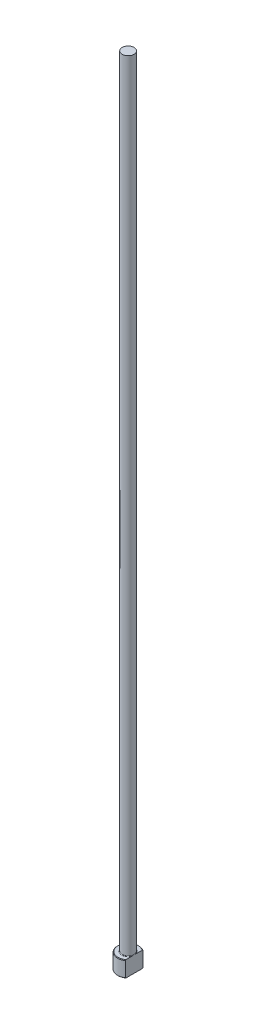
ISO-10303-21;
HEADER;
FILE_DESCRIPTION(('STEP AP214'),'2;1');
FILE_NAME('part.step','',(''),(''),'','','');
FILE_SCHEMA(('AUTOMOTIVE_DESIGN { 1 0 10303 214 1 1 1 1 }'));
ENDSEC;
DATA;
#1=APPLICATION_CONTEXT('core data for automotive mechanical design processes');
#2=APPLICATION_PROTOCOL_DEFINITION('international standard','automotive_design',2000,#1);
#3=PRODUCT_CONTEXT('',#1,'mechanical');
#4=PRODUCT('Part','Part','',(#3));
#5=PRODUCT_RELATED_PRODUCT_CATEGORY('part','',(#4));
#6=PRODUCT_DEFINITION_FORMATION('','',#4);
#7=PRODUCT_DEFINITION_CONTEXT('part definition',#1,'design');
#8=PRODUCT_DEFINITION('design','',#6,#7);
#9=PRODUCT_DEFINITION_SHAPE('','',#8);
#10=(LENGTH_UNIT() NAMED_UNIT(*) SI_UNIT(.MILLI.,.METRE.));
#11=(NAMED_UNIT(*) PLANE_ANGLE_UNIT() SI_UNIT($,.RADIAN.));
#12=(NAMED_UNIT(*) SI_UNIT($,.STERADIAN.) SOLID_ANGLE_UNIT());
#13=UNCERTAINTY_MEASURE_WITH_UNIT(LENGTH_MEASURE(1.E-05),#10,'distance_accuracy_value','');
#14=(GEOMETRIC_REPRESENTATION_CONTEXT(3) GLOBAL_UNCERTAINTY_ASSIGNED_CONTEXT((#13)) GLOBAL_UNIT_ASSIGNED_CONTEXT((#10,
#11,#12)) REPRESENTATION_CONTEXT('',''));
#15=CARTESIAN_POINT('',(0.,0.,0.));
#16=DIRECTION('',(0.,0.,1.));
#17=DIRECTION('',(1.,0.,0.));
#18=AXIS2_PLACEMENT_3D('',#15,#16,#17);
#19=CARTESIAN_POINT('',(0.,0.,0.));
#20=DIRECTION('',(0.,-1.,0.));
#21=DIRECTION('',(0.,0.,-1.));
#22=AXIS2_PLACEMENT_3D('',#19,#20,#21);
#23=PLANE('',#22);
#24=CARTESIAN_POINT('',(0.,0.,0.));
#25=DIRECTION('',(0.,-1.,0.));
#26=DIRECTION('',(0.,0.,-1.));
#27=AXIS2_PLACEMENT_3D('',#24,#25,#26);
#28=CIRCLE('',#27,3.79999999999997);
#29=CARTESIAN_POINT('',(2.24999999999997,0.,3.0622703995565));
#30=VERTEX_POINT('',#29);
#31=CARTESIAN_POINT('',(2.24999999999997,0.,-3.0622703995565));
#32=VERTEX_POINT('',#31);
#33=EDGE_CURVE('E98',#30,#32,#28,.T.);
#34=ORIENTED_EDGE('',*,*,#33,.T.);
#35=DIRECTION('',(0.,0.,1.));
#36=VECTOR('',#35,1.);
#37=CARTESIAN_POINT('',(2.24999999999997,0.,3.30718913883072));
#38=LINE('',#37,#36);
#39=EDGE_CURVE('E83',#32,#30,#38,.T.);
#40=ORIENTED_EDGE('',*,*,#39,.T.);
#41=EDGE_LOOP('',(#34,#40));
#42=FACE_BOUND('',#41,.T.);
#43=ADVANCED_FACE('F32',(#42),#23,.T.);
#44=CARTESIAN_POINT('',(0.,259.958771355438,0.));
#45=DIRECTION('',(0.,1.,0.));
#46=DIRECTION('',(0.,0.,1.));
#47=AXIS2_PLACEMENT_3D('',#44,#45,#46);
#48=CYLINDRICAL_SURFACE('',#47,3.99999999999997);
#49=CARTESIAN_POINT('',(0.,5.80000000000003,0.));
#50=DIRECTION('',(0.,1.,0.));
#51=DIRECTION('',(0.,0.,1.));
#52=AXIS2_PLACEMENT_3D('',#49,#50,#51);
#53=CIRCLE('',#52,3.99999999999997);
#54=CARTESIAN_POINT('',(2.24999999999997,5.80000000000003,3.30718913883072));
#55=VERTEX_POINT('',#54);
#56=CARTESIAN_POINT('',(2.24999999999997,5.80000000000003,-3.30718913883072));
#57=VERTEX_POINT('',#56);
#58=EDGE_CURVE('E104',#55,#57,#53,.F.);
#59=ORIENTED_EDGE('',*,*,#58,.T.);
#60=DIRECTION('',(0.,-1.,0.));
#61=VECTOR('',#60,1.);
#62=CARTESIAN_POINT('',(2.24999999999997,300.,-3.30718913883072));
#63=LINE('',#62,#61);
#64=CARTESIAN_POINT('',(2.24999999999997,0.199999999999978,-3.30718913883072));
#65=VERTEX_POINT('',#64);
#66=EDGE_CURVE('E183',#57,#65,#63,.T.);
#67=ORIENTED_EDGE('',*,*,#66,.T.);
#68=CARTESIAN_POINT('',(0.,0.199999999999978,0.));
#69=DIRECTION('',(0.,-1.,0.));
#70=DIRECTION('',(0.,0.,-1.));
#71=AXIS2_PLACEMENT_3D('',#68,#69,#70);
#72=CIRCLE('',#71,3.99999999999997);
#73=CARTESIAN_POINT('',(2.24999999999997,0.199999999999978,3.30718913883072));
#74=VERTEX_POINT('',#73);
#75=EDGE_CURVE('E100',#65,#74,#72,.F.);
#76=ORIENTED_EDGE('',*,*,#75,.T.);
#77=DIRECTION('',(0.,-1.,0.));
#78=VECTOR('',#77,1.);
#79=CARTESIAN_POINT('',(2.24999999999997,300.,3.30718913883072));
#80=LINE('',#79,#78);
#81=EDGE_CURVE('E93',#55,#74,#80,.T.);
#82=ORIENTED_EDGE('',*,*,#81,.F.);
#83=EDGE_LOOP('',(#59,#67,#76,#82));
#84=FACE_BOUND('',#83,.T.);
#85=ADVANCED_FACE('F158',(#84),#48,.T.);
#86=CARTESIAN_POINT('',(-3.99999999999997,6.,0.));
#87=DIRECTION('',(0.,1.,0.));
#88=DIRECTION('',(0.,0.,1.));
#89=AXIS2_PLACEMENT_3D('',#86,#87,#88);
#90=PLANE('',#89);
#91=CARTESIAN_POINT('',(0.,6.,0.));
#92=DIRECTION('',(0.,1.,0.));
#93=DIRECTION('',(0.,0.,1.));
#94=AXIS2_PLACEMENT_3D('',#91,#92,#93);
#95=CIRCLE('',#94,3.8);
#96=CARTESIAN_POINT('',(2.24999999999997,6.,-3.06227039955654));
#97=VERTEX_POINT('',#96);
#98=CARTESIAN_POINT('',(2.24999999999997,6.,3.06227039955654));
#99=VERTEX_POINT('',#98);
#100=EDGE_CURVE('E178',#97,#99,#95,.T.);
#101=ORIENTED_EDGE('',*,*,#100,.T.);
#102=DIRECTION('',(0.,0.,-1.));
#103=VECTOR('',#102,1.);
#104=CARTESIAN_POINT('',(2.24999999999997,6.,0.));
#105=LINE('',#104,#103);
#106=CARTESIAN_POINT('',(2.24999999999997,5.99999999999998,0.96953597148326));
#107=VERTEX_POINT('',#106);
#108=EDGE_CURVE('E57',#99,#107,#105,.T.);
#109=ORIENTED_EDGE('',*,*,#108,.T.);
#110=CARTESIAN_POINT('',(0.,6.,0.));
#111=DIRECTION('',(0.,1.,0.));
#112=DIRECTION('',(0.,0.,1.));
#113=AXIS2_PLACEMENT_3D('',#110,#111,#112);
#114=CIRCLE('',#113,2.44999999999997);
#115=CARTESIAN_POINT('',(2.24999999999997,5.99999999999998,-0.969535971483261));
#116=VERTEX_POINT('',#115);
#117=EDGE_CURVE('E107',#107,#116,#114,.F.);
#118=ORIENTED_EDGE('',*,*,#117,.T.);
#119=EDGE_CURVE('E136',#116,#97,#105,.T.);
#120=ORIENTED_EDGE('',*,*,#119,.T.);
#121=EDGE_LOOP('',(#101,#109,#118,#120));
#122=FACE_BOUND('',#121,.T.);
#123=ADVANCED_FACE('F147',(#122),#90,.T.);
#124=CARTESIAN_POINT('',(0.,6.00000000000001,0.));
#125=DIRECTION('',(0.,-1.,0.));
#126=DIRECTION('',(0.,0.,-1.));
#127=AXIS2_PLACEMENT_3D('',#124,#125,#126);
#128=CONICAL_SURFACE('',#127,3.8,0.785398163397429);
#129=ORIENTED_EDGE('',*,*,#58,.F.);
#130=CARTESIAN_POINT('',(2.24999999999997,2.1823029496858,7.27782992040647));
#131=CARTESIAN_POINT('',(2.24999999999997,2.30866715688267,7.14556140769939));
#132=CARTESIAN_POINT('',(2.24999999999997,2.43487774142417,7.01314597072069));
#133=CARTESIAN_POINT('',(2.24999999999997,2.68692885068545,6.74796170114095));
#134=CARTESIAN_POINT('',(2.24999999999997,2.81276937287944,6.61519286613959));
#135=CARTESIAN_POINT('',(2.24999999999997,3.18970572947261,6.21619905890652));
#136=CARTESIAN_POINT('',(2.24999999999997,3.44014920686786,5.94935693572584));
#137=CARTESIAN_POINT('',(2.24999999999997,3.9402606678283,5.41146981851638));
#138=CARTESIAN_POINT('',(2.24999999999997,4.18991116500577,5.14040850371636));
#139=CARTESIAN_POINT('',(2.24999999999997,4.56140055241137,4.73113683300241));
#140=CARTESIAN_POINT('',(2.24999999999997,4.68472451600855,4.59427552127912));
#141=CARTESIAN_POINT('',(2.24999999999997,4.93009407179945,4.31941326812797));
#142=CARTESIAN_POINT('',(2.24999999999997,5.05213967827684,4.18141233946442));
#143=CARTESIAN_POINT('',(2.24999999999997,5.31419582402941,3.88150807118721));
#144=CARTESIAN_POINT('',(2.24999999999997,5.45391708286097,3.71935099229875));
#145=CARTESIAN_POINT('',(2.24999999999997,5.73025215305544,3.39234412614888));
#146=CARTESIAN_POINT('',(2.24999999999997,5.86686529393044,3.22749377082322));
#147=CARTESIAN_POINT('',(2.24999999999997,6.13534139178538,2.89430849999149));
#148=CARTESIAN_POINT('',(2.24999999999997,6.26721073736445,2.72597879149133));
#149=CARTESIAN_POINT('',(2.24999999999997,6.45966785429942,2.46950762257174));
#150=CARTESIAN_POINT('',(2.24999999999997,6.52291962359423,2.38336821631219));
#151=CARTESIAN_POINT('',(2.24999999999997,6.64714184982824,2.20946418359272));
#152=CARTESIAN_POINT('',(2.24999999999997,6.70811252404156,2.12169971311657));
#153=CARTESIAN_POINT('',(2.24999999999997,6.82102230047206,1.95327886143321));
#154=CARTESIAN_POINT('',(2.24999999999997,6.87324695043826,1.87281476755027));
#155=CARTESIAN_POINT('',(2.24999999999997,6.97467249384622,1.70998172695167));
#156=CARTESIAN_POINT('',(2.24999999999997,7.02387305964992,1.62761257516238));
#157=CARTESIAN_POINT('',(2.24999999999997,7.11837607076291,1.46059799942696));
#158=CARTESIAN_POINT('',(2.24999999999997,7.16367708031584,1.37595175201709));
#159=CARTESIAN_POINT('',(2.24999999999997,7.24914050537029,1.20413766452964));
#160=CARTESIAN_POINT('',(2.24999999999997,7.28930406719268,1.11697039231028));
#161=CARTESIAN_POINT('',(2.24999999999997,7.38314726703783,0.89117584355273));
#162=CARTESIAN_POINT('',(2.24999999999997,7.4321974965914,0.750488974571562));
#163=CARTESIAN_POINT('',(2.24999999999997,7.48826674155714,0.535159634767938));
#164=CARTESIAN_POINT('',(2.24999999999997,7.50402844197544,0.462776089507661));
#165=CARTESIAN_POINT('',(2.24999999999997,7.52893388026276,0.316860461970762));
#166=CARTESIAN_POINT('',(2.24999999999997,7.53807847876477,0.243328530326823));
#167=CARTESIAN_POINT('',(2.24999999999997,7.54922474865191,0.0949504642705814));
#168=CARTESIAN_POINT('',(2.24999999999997,7.55115152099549,0.0200986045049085));
#169=CARTESIAN_POINT('',(2.24999999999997,7.54752076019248,-0.129420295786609));
#170=CARTESIAN_POINT('',(2.24999999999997,7.54196316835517,-0.204087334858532));
#171=CARTESIAN_POINT('',(2.24999999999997,7.52372329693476,-0.352688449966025));
#172=CARTESIAN_POINT('',(2.24999999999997,7.51102617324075,-0.42662067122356));
#173=CARTESIAN_POINT('',(2.24999999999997,7.47926333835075,-0.573094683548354));
#174=CARTESIAN_POINT('',(2.24999999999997,7.46019612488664,-0.645636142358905));
#175=CARTESIAN_POINT('',(2.24999999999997,7.40610994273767,-0.823701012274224));
#176=CARTESIAN_POINT('',(2.24999999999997,7.3678344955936,-0.92823085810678));
#177=CARTESIAN_POINT('',(2.24999999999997,7.28232692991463,-1.13354070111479));
#178=CARTESIAN_POINT('',(2.24999999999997,7.23508812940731,-1.23431783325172));
#179=CARTESIAN_POINT('',(2.24999999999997,7.13380125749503,-1.43298762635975));
#180=CARTESIAN_POINT('',(2.24999999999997,7.07972026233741,-1.53086330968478));
#181=CARTESIAN_POINT('',(2.24999999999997,6.99496203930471,-1.67548648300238));
#182=CARTESIAN_POINT('',(2.24999999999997,6.96610811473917,-1.72332162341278));
#183=CARTESIAN_POINT('',(2.24999999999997,6.90734436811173,-1.81833709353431));
#184=CARTESIAN_POINT('',(2.24999999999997,6.87743458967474,-1.86551745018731));
#185=CARTESIAN_POINT('',(2.24999999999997,6.77509597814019,-2.02354622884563));
#186=CARTESIAN_POINT('',(2.24999999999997,6.70057106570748,-2.13303820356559));
#187=CARTESIAN_POINT('',(2.24999999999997,6.54784662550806,-2.34943854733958));
#188=CARTESIAN_POINT('',(2.24999999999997,6.46964624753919,-2.45634630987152));
#189=CARTESIAN_POINT('',(2.24999999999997,6.31046802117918,-2.66818697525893));
#190=CARTESIAN_POINT('',(2.24999999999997,6.22948822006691,-2.7731184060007));
#191=CARTESIAN_POINT('',(2.24999999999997,6.06545223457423,-2.98134898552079));
#192=CARTESIAN_POINT('',(2.24999999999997,5.98239592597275,-3.08464803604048));
#193=CARTESIAN_POINT('',(2.24999999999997,5.73044258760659,-3.39308007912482));
#194=CARTESIAN_POINT('',(2.24999999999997,5.55914389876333,-3.59624854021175));
#195=CARTESIAN_POINT('',(2.24999999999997,5.21260420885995,-3.99901521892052));
#196=CARTESIAN_POINT('',(2.24999999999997,5.03736490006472,-4.19861490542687));
#197=CARTESIAN_POINT('',(2.24999999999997,4.68403823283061,-4.59551245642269));
#198=CARTESIAN_POINT('',(2.24999999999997,4.5059490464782,-4.79280869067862));
#199=CARTESIAN_POINT('',(2.24999999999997,4.14782580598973,-5.18566037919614));
#200=CARTESIAN_POINT('',(2.24999999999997,3.96779155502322,-5.38121565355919));
#201=CARTESIAN_POINT('',(2.24999999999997,3.60651922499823,-5.77078870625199));
#202=CARTESIAN_POINT('',(2.24999999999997,3.42528278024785,-5.96480800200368));
#203=CARTESIAN_POINT('',(2.24999999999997,3.06174631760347,-6.3518476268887));
#204=CARTESIAN_POINT('',(2.24999999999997,2.87944629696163,-6.54486795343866));
#205=CARTESIAN_POINT('',(2.24999999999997,2.61112326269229,-6.82775668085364));
#206=CARTESIAN_POINT('',(2.24999999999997,2.52542128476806,-6.91792994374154));
#207=CARTESIAN_POINT('',(2.24999999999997,2.35393773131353,-7.09803491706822));
#208=CARTESIAN_POINT('',(2.24999999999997,2.26815631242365,-7.18796677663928));
#209=CARTESIAN_POINT('',(2.24999999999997,2.1823029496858,-7.27782992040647));
#210=B_SPLINE_CURVE_WITH_KNOTS('',3,(#130,#131,#132,#133,#134,#135,#136,#137,#138,#139,#140,
#141,#142,#143,#144,#145,#146,#147,#148,#149,#150,#151,#152,#153,#154,#155,#156,#157,#158,#159,
#160,#161,#162,#163,#164,#165,#166,#167,#168,#169,#170,#171,#172,#173,#174,#175,#176,#177,#178,
#179,#180,#181,#182,#183,#184,#185,#186,#187,#188,#189,#190,#191,#192,#193,#194,#195,#196,#197,
#198,#199,#200,#201,#202,#203,#204,#205,#206,#207,#208,#209),.UNSPECIFIED.,.F.,.F.,(4,2,2,2,2,2,
2,2,2,2,2,2,2,2,2,2,2,2,2,2,2,2,2,2,2,2,2,2,2,2,2,2,2,2,2,2,2,2,2,4),(0.,0.548785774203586,
1.09757528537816,2.19544562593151,3.30094607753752,3.85362276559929,4.40629327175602,
5.04841012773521,5.69066421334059,6.33201824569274,6.65259523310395,6.97314160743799,
7.26086761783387,7.54862474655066,7.83648737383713,8.12428565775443,8.56956070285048,
8.79154735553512,9.01350513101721,9.23775987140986,9.46201637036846,9.68674086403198,
9.91151839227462,10.2448678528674,10.5784668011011,10.9137368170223,11.0813178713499,
11.2488920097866,11.6461164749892,12.0434332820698,12.4410351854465,12.8386609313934,
13.6357991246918,14.43260129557,15.2299368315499,16.0273538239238,16.8238479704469,
17.6203441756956,17.9935523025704,18.3664002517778),.UNSPECIFIED.);
#211=EDGE_CURVE('E135',#55,#99,#210,.T.);
#212=ORIENTED_EDGE('',*,*,#211,.T.);
#213=ORIENTED_EDGE('',*,*,#100,.F.);
#214=EDGE_CURVE('E127',#97,#57,#210,.T.);
#215=ORIENTED_EDGE('',*,*,#214,.T.);
#216=EDGE_LOOP('',(#129,#212,#213,#215));
#217=FACE_BOUND('',#216,.T.);
#218=ADVANCED_FACE('F143',(#217),#128,.T.);
#219=CARTESIAN_POINT('',(0.,0.199999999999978,0.));
#220=DIRECTION('',(0.,1.,0.));
#221=DIRECTION('',(0.,0.,1.));
#222=AXIS2_PLACEMENT_3D('',#219,#220,#221);
#223=CONICAL_SURFACE('',#222,3.99999999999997,0.785398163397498);
#224=ORIENTED_EDGE('',*,*,#75,.F.);
#225=CARTESIAN_POINT('',(2.24999999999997,3.81769705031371,-7.27782992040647));
#226=CARTESIAN_POINT('',(2.24999999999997,3.69133284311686,-7.14556140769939));
#227=CARTESIAN_POINT('',(2.24999999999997,3.56512225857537,-7.01314597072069));
#228=CARTESIAN_POINT('',(2.24999999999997,3.31307114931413,-6.74796170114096));
#229=CARTESIAN_POINT('',(2.24999999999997,3.18723062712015,-6.6151928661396));
#230=CARTESIAN_POINT('',(2.24999999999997,2.81029427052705,-6.21619905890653));
#231=CARTESIAN_POINT('',(2.24999999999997,2.55985079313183,-5.94935693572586));
#232=CARTESIAN_POINT('',(2.24999999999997,2.05973933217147,-5.4114698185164));
#233=CARTESIAN_POINT('',(2.24999999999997,1.81008883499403,-5.14040850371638));
#234=CARTESIAN_POINT('',(2.24999999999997,1.43859944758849,-4.73113683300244));
#235=CARTESIAN_POINT('',(2.24999999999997,1.31527548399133,-4.59427552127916));
#236=CARTESIAN_POINT('',(2.24999999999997,1.06990592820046,-4.319413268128));
#237=CARTESIAN_POINT('',(2.24999999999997,0.947860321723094,-4.18141233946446));
#238=CARTESIAN_POINT('',(2.24999999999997,0.685804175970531,-3.88150807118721));
#239=CARTESIAN_POINT('',(2.24999999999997,0.546082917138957,-3.71935099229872));
#240=CARTESIAN_POINT('',(2.24999999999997,0.269747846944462,-3.39234412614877));
#241=CARTESIAN_POINT('',(2.24999999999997,0.133134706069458,-3.22749377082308));
#242=CARTESIAN_POINT('',(2.24999999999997,-0.135341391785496,-2.89430849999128));
#243=CARTESIAN_POINT('',(2.24999999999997,-0.267210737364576,-2.72597879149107));
#244=CARTESIAN_POINT('',(2.24999999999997,-0.459667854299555,-2.46950762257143));
#245=CARTESIAN_POINT('',(2.24999999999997,-0.522919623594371,-2.38336821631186));
#246=CARTESIAN_POINT('',(2.24999999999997,-0.64714184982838,-2.20946418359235));
#247=CARTESIAN_POINT('',(2.24999999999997,-0.708112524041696,-2.12169971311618));
#248=CARTESIAN_POINT('',(2.24999999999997,-0.821022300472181,-1.9532788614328));
#249=CARTESIAN_POINT('',(2.24999999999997,-0.87324695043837,-1.87281476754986));
#250=CARTESIAN_POINT('',(2.24999999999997,-0.974672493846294,-1.70998172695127));
#251=CARTESIAN_POINT('',(2.24999999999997,-1.02387305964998,-1.62761257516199));
#252=CARTESIAN_POINT('',(2.24999999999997,-1.11837607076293,-1.46059799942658));
#253=CARTESIAN_POINT('',(2.24999999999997,-1.16367708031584,-1.37595175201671));
#254=CARTESIAN_POINT('',(2.24999999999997,-1.24914050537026,-1.20413766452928));
#255=CARTESIAN_POINT('',(2.24999999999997,-1.28930406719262,-1.11697039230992));
#256=CARTESIAN_POINT('',(2.24999999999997,-1.38314726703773,-0.891175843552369));
#257=CARTESIAN_POINT('',(2.24999999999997,-1.43219749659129,-0.750488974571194));
#258=CARTESIAN_POINT('',(2.24999999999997,-1.48826674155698,-0.535159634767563));
#259=CARTESIAN_POINT('',(2.24999999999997,-1.50402844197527,-0.462776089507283));
#260=CARTESIAN_POINT('',(2.24999999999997,-1.52893388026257,-0.316860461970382));
#261=CARTESIAN_POINT('',(2.24999999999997,-1.53807847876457,-0.243328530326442));
#262=CARTESIAN_POINT('',(2.24999999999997,-1.54922474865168,-0.0949504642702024));
#263=CARTESIAN_POINT('',(2.24999999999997,-1.55115152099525,-0.0200986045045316));
#264=CARTESIAN_POINT('',(2.24999999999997,-1.54752076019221,0.129420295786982));
#265=CARTESIAN_POINT('',(2.24999999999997,-1.54196316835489,0.204087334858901));
#266=CARTESIAN_POINT('',(2.24999999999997,-1.52372329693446,0.352688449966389));
#267=CARTESIAN_POINT('',(2.24999999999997,-1.51102617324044,0.42662067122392));
#268=CARTESIAN_POINT('',(2.24999999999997,-1.47926333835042,0.573094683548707));
#269=CARTESIAN_POINT('',(2.24999999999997,-1.46019612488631,0.645636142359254));
#270=CARTESIAN_POINT('',(2.24999999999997,-1.40610994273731,0.823701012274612));
#271=CARTESIAN_POINT('',(2.24999999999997,-1.36783449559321,0.92823085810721));
#272=CARTESIAN_POINT('',(2.24999999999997,-1.28232692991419,1.1335407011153));
#273=CARTESIAN_POINT('',(2.24999999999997,-1.23508812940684,1.23431783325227));
#274=CARTESIAN_POINT('',(2.24999999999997,-1.13380125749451,1.43298762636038));
#275=CARTESIAN_POINT('',(2.24999999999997,-1.07972026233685,1.53086330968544));
#276=CARTESIAN_POINT('',(2.24999999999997,-0.994962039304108,1.6754864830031));
#277=CARTESIAN_POINT('',(2.24999999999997,-0.966108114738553,1.72332162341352));
#278=CARTESIAN_POINT('',(2.24999999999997,-0.907344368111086,1.81833709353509));
#279=CARTESIAN_POINT('',(2.24999999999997,-0.877434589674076,1.8655174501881));
#280=CARTESIAN_POINT('',(2.24999999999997,-0.775095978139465,2.0235462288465));
#281=CARTESIAN_POINT('',(2.24999999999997,-0.700571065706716,2.13303820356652));
#282=CARTESIAN_POINT('',(2.24999999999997,-0.547846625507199,2.34943854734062));
#283=CARTESIAN_POINT('',(2.24999999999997,-0.469646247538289,2.45634630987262));
#284=CARTESIAN_POINT('',(2.24999999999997,-0.310468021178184,2.66818697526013));
#285=CARTESIAN_POINT('',(2.24999999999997,-0.229488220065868,2.77311840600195));
#286=CARTESIAN_POINT('',(2.24999999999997,-0.065452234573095,2.98134898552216));
#287=CARTESIAN_POINT('',(2.24999999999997,0.0176040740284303,3.0846480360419));
#288=CARTESIAN_POINT('',(2.24999999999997,0.269557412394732,3.39308007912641));
#289=CARTESIAN_POINT('',(2.24999999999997,0.440856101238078,3.59624854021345));
#290=CARTESIAN_POINT('',(2.24999999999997,0.787395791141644,3.99901521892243));
#291=CARTESIAN_POINT('',(2.24999999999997,0.962635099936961,4.19861490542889));
#292=CARTESIAN_POINT('',(2.24999999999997,1.31596176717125,4.59551245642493));
#293=CARTESIAN_POINT('',(2.24999999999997,1.49405095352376,4.79280869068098));
#294=CARTESIAN_POINT('',(2.24999999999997,1.8521741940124,5.18566037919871));
#295=CARTESIAN_POINT('',(2.24999999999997,2.03220844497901,5.38121565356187));
#296=CARTESIAN_POINT('',(2.24999999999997,2.39348077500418,5.7707887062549));
#297=CARTESIAN_POINT('',(2.24999999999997,2.57471721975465,5.9648080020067));
#298=CARTESIAN_POINT('',(2.24999999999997,2.93825368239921,6.35184762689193));
#299=CARTESIAN_POINT('',(2.24999999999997,3.12055370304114,6.54486795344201));
#300=CARTESIAN_POINT('',(2.24999999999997,3.38887673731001,6.82775668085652));
#301=CARTESIAN_POINT('',(2.24999999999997,3.47457871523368,6.91792994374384));
#302=CARTESIAN_POINT('',(2.24999999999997,3.64606226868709,7.09803491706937));
#303=CARTESIAN_POINT('',(2.24999999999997,3.73184368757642,7.18796677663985));
#304=CARTESIAN_POINT('',(2.24999999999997,3.81769705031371,7.27782992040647));
#305=B_SPLINE_CURVE_WITH_KNOTS('',3,(#225,#226,#227,#228,#229,#230,#231,#232,#233,#234,#235,
#236,#237,#238,#239,#240,#241,#242,#243,#244,#245,#246,#247,#248,#249,#250,#251,#252,#253,#254,
#255,#256,#257,#258,#259,#260,#261,#262,#263,#264,#265,#266,#267,#268,#269,#270,#271,#272,#273,
#274,#275,#276,#277,#278,#279,#280,#281,#282,#283,#284,#285,#286,#287,#288,#289,#290,#291,#292,
#293,#294,#295,#296,#297,#298,#299,#300,#301,#302,#303,#304),.UNSPECIFIED.,.F.,.F.,(4,2,2,2,2,2,
2,2,2,2,2,2,2,2,2,2,2,2,2,2,2,2,2,2,2,2,2,2,2,2,2,2,2,2,2,2,2,2,2,4),(0.,0.548785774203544,
1.09757528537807,2.19544562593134,3.30094607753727,3.853622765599,4.40629327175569,
5.04841012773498,5.69066421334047,6.33201824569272,6.65259523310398,6.97314160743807,
7.26086761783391,7.54862474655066,7.8364873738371,8.12428565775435,8.56956070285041,
8.79154735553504,9.01350513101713,9.23775987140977,9.46201637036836,9.68674086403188,
9.91151839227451,10.2448678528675,10.5784668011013,10.9137368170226,11.0813178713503,
11.2488920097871,11.6461164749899,12.0434332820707,12.4410351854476,12.8386609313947,
13.6357991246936,14.4326012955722,15.2299368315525,16.0273538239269,16.8238479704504,
17.6203441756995,17.9935523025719,18.3664002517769),.UNSPECIFIED.);
#306=EDGE_CURVE('E86',#65,#32,#305,.T.);
#307=ORIENTED_EDGE('',*,*,#306,.T.);
#308=ORIENTED_EDGE('',*,*,#33,.F.);
#309=EDGE_CURVE('E89',#30,#74,#305,.T.);
#310=ORIENTED_EDGE('',*,*,#309,.T.);
#311=EDGE_LOOP('',(#224,#307,#308,#310));
#312=FACE_BOUND('',#311,.T.);
#313=ADVANCED_FACE('F97',(#312),#223,.T.);
#314=CARTESIAN_POINT('',(0.,6.19999999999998,0.));
#315=DIRECTION('',(0.,1.,0.));
#316=DIRECTION('',(0.,0.,1.));
#317=AXIS2_PLACEMENT_3D('',#314,#315,#316);
#318=TOROIDAL_SURFACE('',#317,2.44999999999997,0.2);
#319=CARTESIAN_POINT('',(2.24999999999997,6.19999999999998,0.));
#320=CARTESIAN_POINT('',(2.24999999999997,6.2000005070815,6.44724382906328E-11));
#321=CARTESIAN_POINT('',(2.24999999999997,6.20000101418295,-1.58891197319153E-07));
#322=CARTESIAN_POINT('',(2.24999999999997,6.20000197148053,-6.21779259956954E-07));
#323=CARTESIAN_POINT('',(2.24999999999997,6.20000241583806,-9.34460784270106E-07));
#324=CARTESIAN_POINT('',(2.24999999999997,6.20000332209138,-1.68105194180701E-06));
#325=CARTESIAN_POINT('',(2.24999999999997,6.20000377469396,-2.12646377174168E-06));
#326=CARTESIAN_POINT('',(2.24999999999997,6.20000460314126,-3.06333881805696E-06));
#327=CARTESIAN_POINT('',(2.24999999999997,6.20000498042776,-3.55360522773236E-06));
#328=CARTESIAN_POINT('',(2.24999999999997,6.20000633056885,-5.39956017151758E-06));
#329=CARTESIAN_POINT('',(2.24999999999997,6.20000722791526,-6.81237630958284E-06));
#330=CARTESIAN_POINT('',(2.24999999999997,6.20000875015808,-9.6531589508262E-06));
#331=CARTESIAN_POINT('',(2.24999999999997,6.20000938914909,-1.10739428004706E-05));
#332=CARTESIAN_POINT('',(2.24999999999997,6.20001197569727,-1.69289388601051E-05));
#333=CARTESIAN_POINT('',(2.24999999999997,6.20001384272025,-2.14029810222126E-05));
#334=CARTESIAN_POINT('',(2.24999999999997,6.20001668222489,-2.99701702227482E-05));
#335=CARTESIAN_POINT('',(2.24999999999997,6.20001774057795,-3.40349909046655E-05));
#336=CARTESIAN_POINT('',(2.24999999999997,6.20002529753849,-6.37611263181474E-05));
#337=CARTESIAN_POINT('',(2.24999999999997,6.20003087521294,-8.9609529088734E-05));
#338=CARTESIAN_POINT('',(2.24999999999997,6.20005527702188,-0.000191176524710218));
#339=CARTESIAN_POINT('',(2.24999999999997,6.20007870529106,-0.000265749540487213));
#340=CARTESIAN_POINT('',(2.24999999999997,6.2001693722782,-0.00055979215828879));
#341=CARTESIAN_POINT('',(2.24999999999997,6.20023350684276,-0.000779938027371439));
#342=CARTESIAN_POINT('',(2.24999999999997,6.20048920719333,-0.00165050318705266));
#343=CARTESIAN_POINT('',(2.24999999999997,6.20068459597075,-0.00230007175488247));
#344=CARTESIAN_POINT('',(2.24999999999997,6.20149322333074,-0.00499620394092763));
#345=CARTESIAN_POINT('',(2.24999999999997,6.2021017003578,-0.00704382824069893));
#346=CARTESIAN_POINT('',(2.24999999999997,6.20797104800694,-0.0267853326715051));
#347=CARTESIAN_POINT('',(2.24999999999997,6.21325284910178,-0.0444747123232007));
#348=CARTESIAN_POINT('',(2.24999999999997,6.22356918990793,-0.0791736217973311));
#349=CARTESIAN_POINT('',(2.24999999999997,6.22860532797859,-0.0961827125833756));
#350=CARTESIAN_POINT('',(2.24999999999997,6.23925368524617,-0.132326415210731));
#351=CARTESIAN_POINT('',(2.24999999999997,6.24485983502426,-0.151462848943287));
#352=CARTESIAN_POINT('',(2.24999999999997,6.25603662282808,-0.18996857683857));
#353=CARTESIAN_POINT('',(2.24999999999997,6.26160623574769,-0.209338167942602));
#354=CARTESIAN_POINT('',(2.24999999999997,6.27500311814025,-0.256523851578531));
#355=CARTESIAN_POINT('',(2.24999999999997,6.28276182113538,-0.284359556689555));
#356=CARTESIAN_POINT('',(2.24999999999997,6.29771346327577,-0.33942534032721));
#357=CARTESIAN_POINT('',(2.24999999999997,6.3049157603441,-0.366652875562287));
#358=CARTESIAN_POINT('',(2.24999999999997,6.32240345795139,-0.435090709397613));
#359=CARTESIAN_POINT('',(2.24999999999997,6.33239618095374,-0.476377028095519));
#360=CARTESIAN_POINT('',(2.24999999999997,6.35100390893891,-0.559624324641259));
#361=CARTESIAN_POINT('',(2.24999999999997,6.3596067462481,-0.60158805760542));
#362=CARTESIAN_POINT('',(2.24999999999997,6.37543235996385,-0.689258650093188));
#363=CARTESIAN_POINT('',(2.24999999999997,6.38248971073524,-0.734996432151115));
#364=CARTESIAN_POINT('',(2.24999999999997,6.39342529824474,-0.826730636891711));
#365=CARTESIAN_POINT('',(2.24999999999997,6.39731270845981,-0.872725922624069));
#366=CARTESIAN_POINT('',(2.24999999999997,6.40071499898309,-0.963783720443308));
#367=CARTESIAN_POINT('',(2.24999999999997,6.40033773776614,-1.00884048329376));
#368=CARTESIAN_POINT('',(2.24999999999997,6.39535803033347,-1.07577565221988));
#369=CARTESIAN_POINT('',(2.24999999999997,6.39299580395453,-1.09781842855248));
#370=CARTESIAN_POINT('',(2.24999999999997,6.38649339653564,-1.1416310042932));
#371=CARTESIAN_POINT('',(2.24999999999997,6.38235512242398,-1.16340107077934));
#372=CARTESIAN_POINT('',(2.24999999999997,6.37178290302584,-1.20664751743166));
#373=CARTESIAN_POINT('',(2.24999999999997,6.36532376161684,-1.22811787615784));
#374=CARTESIAN_POINT('',(2.24999999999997,6.34940253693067,-1.26994619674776));
#375=CARTESIAN_POINT('',(2.24999999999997,6.33994859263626,-1.29030700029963));
#376=CARTESIAN_POINT('',(2.24999999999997,6.32341167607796,-1.31784149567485));
#377=CARTESIAN_POINT('',(2.24999999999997,6.31797729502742,-1.3260012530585));
#378=CARTESIAN_POINT('',(2.24999999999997,6.30618383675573,-1.34165219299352));
#379=CARTESIAN_POINT('',(2.24999999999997,6.29982370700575,-1.34914259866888));
#380=CARTESIAN_POINT('',(2.24999999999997,6.28597385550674,-1.36322511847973));
#381=CARTESIAN_POINT('',(2.24999999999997,6.27846961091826,-1.36980324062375));
#382=CARTESIAN_POINT('',(2.24999999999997,6.26235014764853,-1.38141777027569));
#383=CARTESIAN_POINT('',(2.24999999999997,6.25373945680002,-1.38646019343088));
#384=CARTESIAN_POINT('',(2.24999999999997,6.23893119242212,-1.39291408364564));
#385=CARTESIAN_POINT('',(2.24999999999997,6.23301804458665,-1.39497873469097));
#386=CARTESIAN_POINT('',(2.24999999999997,6.22092968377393,-1.3980973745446));
#387=CARTESIAN_POINT('',(2.24999999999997,6.21475469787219,-1.39915222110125));
#388=CARTESIAN_POINT('',(2.24999999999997,6.20229305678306,-1.4001597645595));
#389=CARTESIAN_POINT('',(2.24999999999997,6.19600609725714,-1.40010876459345));
#390=CARTESIAN_POINT('',(2.24999999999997,6.18353929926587,-1.39890051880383));
#391=CARTESIAN_POINT('',(2.24999999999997,6.17735949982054,-1.39774287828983));
#392=CARTESIAN_POINT('',(2.24999999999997,6.16550896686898,-1.39448677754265));
#393=CARTESIAN_POINT('',(2.24999999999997,6.15982782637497,-1.39242539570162));
#394=CARTESIAN_POINT('',(2.24999999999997,6.14882191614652,-1.38751374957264));
#395=CARTESIAN_POINT('',(2.24999999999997,6.14349727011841,-1.38466321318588));
#396=CARTESIAN_POINT('',(2.24999999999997,6.13026923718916,-1.37647479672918));
#397=CARTESIAN_POINT('',(2.24999999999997,6.12266499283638,-1.37065399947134));
#398=CARTESIAN_POINT('',(2.24999999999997,6.10845647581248,-1.35789458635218));
#399=CARTESIAN_POINT('',(2.24999999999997,6.10185542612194,-1.3509525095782));
#400=CARTESIAN_POINT('',(2.24999999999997,6.0855320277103,-1.33150080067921));
#401=CARTESIAN_POINT('',(2.24999999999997,6.07660573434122,-1.31832816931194));
#402=CARTESIAN_POINT('',(2.24999999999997,6.06078136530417,-1.29086374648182));
#403=CARTESIAN_POINT('',(2.24999999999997,6.05388481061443,-1.27657112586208));
#404=CARTESIAN_POINT('',(2.24999999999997,6.03602738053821,-1.23377116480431));
#405=CARTESIAN_POINT('',(2.24999999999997,6.02722778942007,-1.20437236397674));
#406=CARTESIAN_POINT('',(2.24999999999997,6.01362163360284,-1.14441037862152));
#407=CARTESIAN_POINT('',(2.24999999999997,6.00886464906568,-1.11383741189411));
#408=CARTESIAN_POINT('',(2.24999999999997,6.00105881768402,-1.03966563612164));
#409=CARTESIAN_POINT('',(2.24999999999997,5.99953171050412,-0.995912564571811));
#410=CARTESIAN_POINT('',(2.24999999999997,6.00070174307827,-0.9083672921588));
#411=CARTESIAN_POINT('',(2.24999999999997,6.00341475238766,-0.864575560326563));
#412=CARTESIAN_POINT('',(2.24999999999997,6.01171554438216,-0.779778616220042));
#413=CARTESIAN_POINT('',(2.24999999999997,6.01713219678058,-0.73875579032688));
#414=CARTESIAN_POINT('',(2.24999999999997,6.0300163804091,-0.657360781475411));
#415=CARTESIAN_POINT('',(2.24999999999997,6.03746816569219,-0.616986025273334));
#416=CARTESIAN_POINT('',(2.24999999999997,6.0540572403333,-0.53598173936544));
#417=CARTESIAN_POINT('',(2.24999999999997,6.0632173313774,-0.495356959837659));
#418=CARTESIAN_POINT('',(2.24999999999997,6.08297396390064,-0.413374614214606));
#419=CARTESIAN_POINT('',(2.24999999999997,6.09360096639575,-0.372024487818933));
#420=CARTESIAN_POINT('',(2.24999999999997,6.11230155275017,-0.302306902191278));
#421=CARTESIAN_POINT('',(2.24999999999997,6.12014883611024,-0.273877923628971));
#422=CARTESIAN_POINT('',(2.24999999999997,6.1360590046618,-0.217411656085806));
#423=CARTESIAN_POINT('',(2.24999999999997,6.14411864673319,-0.189373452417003));
#424=CARTESIAN_POINT('',(2.24999999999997,6.15951571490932,-0.136466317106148));
#425=CARTESIAN_POINT('',(2.24999999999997,6.16683378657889,-0.111591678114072));
#426=CARTESIAN_POINT('',(2.24999999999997,6.18187191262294,-0.0608432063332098));
#427=CARTESIAN_POINT('',(2.24999999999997,6.18959608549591,-0.0349705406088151));
#428=CARTESIAN_POINT('',(2.24999999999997,6.19789887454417,-0.00704171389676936));
#429=CARTESIAN_POINT('',(2.24999999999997,6.19850801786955,-0.00499199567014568));
#430=CARTESIAN_POINT('',(2.24999999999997,6.19931680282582,-0.00229537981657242));
#431=CARTESIAN_POINT('',(2.24999999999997,6.19951170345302,-0.00164742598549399));
#432=CARTESIAN_POINT('',(2.24999999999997,6.19976680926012,-0.000778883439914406));
#433=CARTESIAN_POINT('',(2.24999999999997,6.19983082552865,-0.000559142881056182));
#434=CARTESIAN_POINT('',(2.24999999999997,6.19992134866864,-0.000265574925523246));
#435=CARTESIAN_POINT('',(2.24999999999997,6.19994475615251,-0.000191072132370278));
#436=CARTESIAN_POINT('',(2.24999999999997,6.1999691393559,-8.95867312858E-05));
#437=CARTESIAN_POINT('',(2.24999999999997,6.19997471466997,-6.37485909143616E-05));
#438=CARTESIAN_POINT('',(2.24999999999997,6.19998226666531,-3.40328344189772E-05));
#439=CARTESIAN_POINT('',(2.24999999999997,6.19998332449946,-2.99686231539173E-05));
#440=CARTESIAN_POINT('',(2.24999999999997,6.19998616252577,-2.1402647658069E-05));
#441=CARTESIAN_POINT('',(2.24999999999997,6.19998802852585,-1.69291780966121E-05));
#442=CARTESIAN_POINT('',(2.24999999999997,6.19999061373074,-1.10747628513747E-05));
#443=CARTESIAN_POINT('',(2.24999999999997,6.19999125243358,-9.65402457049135E-06));
#444=CARTESIAN_POINT('',(2.24999999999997,6.19999277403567,-6.81328226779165E-06));
#445=CARTESIAN_POINT('',(2.24999999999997,6.19999367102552,-5.40045593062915E-06));
#446=CARTESIAN_POINT('',(2.24999999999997,6.19999502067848,-3.55442707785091E-06));
#447=CARTESIAN_POINT('',(2.24999999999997,6.19999539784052,-3.06412589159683E-06));
#448=CARTESIAN_POINT('',(2.24999999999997,6.19999622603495,-2.12715884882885E-06));
#449=CARTESIAN_POINT('',(2.24999999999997,6.19999667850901,-1.68168921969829E-06));
#450=CARTESIAN_POINT('',(2.24999999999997,6.19999758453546,-9.3496060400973E-07));
#451=CARTESIAN_POINT('',(2.24999999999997,6.19999802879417,-6.22203859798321E-07));
#452=CARTESIAN_POINT('',(2.24999999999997,6.1999989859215,-1.59128814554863E-07));
#453=CARTESIAN_POINT('',(2.24999999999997,6.19999949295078,-6.44683302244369E-11));
#454=CARTESIAN_POINT('',(2.24999999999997,6.19999999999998,0.));
#455=B_SPLINE_CURVE_WITH_KNOTS('',3,(#319,#320,#321,#322,#323,#324,#325,#326,#327,#328,#329,
#330,#331,#332,#333,#334,#335,#336,#337,#338,#339,#340,#341,#342,#343,#344,#345,#346,#347,#348,
#349,#350,#351,#352,#353,#354,#355,#356,#357,#358,#359,#360,#361,#362,#363,#364,#365,#366,#367,
#368,#369,#370,#371,#372,#373,#374,#375,#376,#377,#378,#379,#380,#381,#382,#383,#384,#385,#386,
#387,#388,#389,#390,#391,#392,#393,#394,#395,#396,#397,#398,#399,#400,#401,#402,#403,#404,#405,
#406,#407,#408,#409,#410,#411,#412,#413,#414,#415,#416,#417,#418,#419,#420,#421,#422,#423,#424,
#425,#426,#427,#428,#429,#430,#431,#432,#433,#434,#435,#436,#437,#438,#439,#440,#441,#442,#443,
#444,#445,#446,#447,#448,#449,#450,#451,#452,#453,#454),.UNSPECIFIED.,.T.,.F.,(4,2,2,2,2,2,2,2,
2,2,2,2,2,2,2,2,2,2,2,2,2,2,2,2,2,2,2,2,2,2,2,2,2,2,2,2,2,2,2,2,2,2,2,2,2,2,2,2,2,2,2,2,2,2,2,2,
2,2,2,2,2,2,2,2,2,2,2,4),(0.,1.52660877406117E-06,3.15241312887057E-06,5.04759814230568E-06,
6.90201312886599E-06,1.19024879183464E-05,1.65722252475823E-05,3.10841856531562E-05,
4.36688546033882E-05,0.000123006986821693,0.000357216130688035,0.00104540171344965,
0.00308000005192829,0.00948876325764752,0.0648698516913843,0.118087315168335,0.17790910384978,
0.238372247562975,0.325060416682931,0.409550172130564,0.536965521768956,0.665442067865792,
0.804194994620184,0.942544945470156,1.07740386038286,1.14385780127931,1.21024056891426,
1.2773669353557,1.34431241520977,1.37367425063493,1.40306973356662,1.43287536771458,
1.46256269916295,1.48127715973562,1.49997570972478,1.51873677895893,1.53750454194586,
1.55556541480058,1.57363252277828,1.60219661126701,1.63085061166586,1.67831692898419,
1.72581872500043,1.81736829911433,1.91002510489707,2.04102939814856,2.17252517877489,
2.29658958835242,2.41972004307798,2.54462990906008,2.67269769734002,2.76117244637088,
2.84869182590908,2.9264787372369,3.00747864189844,3.01389398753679,3.01592352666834,
3.01661044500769,3.01684443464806,3.01692374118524,3.0169363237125,3.01695083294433,
3.01695550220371,3.01696050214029,3.01696235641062,3.01696425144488,3.01696587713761,
3.01696740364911),.UNSPECIFIED.);
#456=CARTESIAN_POINT('',(2.24999999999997,6.19999999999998,0.));
#457=VERTEX_POINT('',#456);
#458=EDGE_CURVE('E11',#116,#457,#455,.T.);
#459=ORIENTED_EDGE('',*,*,#458,.F.);
#460=ORIENTED_EDGE('',*,*,#117,.F.);
#461=CARTESIAN_POINT('',(2.24999999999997,6.19999999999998,0.));
#462=CARTESIAN_POINT('',(2.24999999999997,6.19999949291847,-6.4472444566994E-11));
#463=CARTESIAN_POINT('',(2.24999999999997,6.19999898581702,1.58891197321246E-07));
#464=CARTESIAN_POINT('',(2.24999999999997,6.19999802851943,6.2177925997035E-07));
#465=CARTESIAN_POINT('',(2.24999999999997,6.1999975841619,9.3446078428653E-07));
#466=CARTESIAN_POINT('',(2.24999999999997,6.19999667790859,1.68105194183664E-06));
#467=CARTESIAN_POINT('',(2.24999999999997,6.199996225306,2.1264637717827E-06));
#468=CARTESIAN_POINT('',(2.24999999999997,6.19999539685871,3.06333881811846E-06));
#469=CARTESIAN_POINT('',(2.24999999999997,6.1999950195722,3.55360522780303E-06));
#470=CARTESIAN_POINT('',(2.24999999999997,6.19999366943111,5.39956017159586E-06));
#471=CARTESIAN_POINT('',(2.24999999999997,6.19999277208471,6.81237630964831E-06));
#472=CARTESIAN_POINT('',(2.24999999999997,6.19999124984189,9.65315895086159E-06));
#473=CARTESIAN_POINT('',(2.24999999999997,6.19999061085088,1.10739428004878E-05));
#474=CARTESIAN_POINT('',(2.24999999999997,6.19998802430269,1.69289388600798E-05));
#475=CARTESIAN_POINT('',(2.24999999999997,6.19998615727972,2.14029810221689E-05));
#476=CARTESIAN_POINT('',(2.24999999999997,6.19998331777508,2.99701702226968E-05));
#477=CARTESIAN_POINT('',(2.24999999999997,6.19998225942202,3.40349909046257E-05));
#478=CARTESIAN_POINT('',(2.24999999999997,6.19997470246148,6.37611263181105E-05));
#479=CARTESIAN_POINT('',(2.24999999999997,6.19996912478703,8.9609529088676E-05));
#480=CARTESIAN_POINT('',(2.24999999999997,6.19994472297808,0.000191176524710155));
#481=CARTESIAN_POINT('',(2.24999999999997,6.1999212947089,0.000265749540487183));
#482=CARTESIAN_POINT('',(2.24999999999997,6.19983062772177,0.000559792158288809));
#483=CARTESIAN_POINT('',(2.24999999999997,6.1997664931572,0.000779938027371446));
#484=CARTESIAN_POINT('',(2.24999999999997,6.19951079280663,0.00165050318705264));
#485=CARTESIAN_POINT('',(2.24999999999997,6.19931540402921,0.00230007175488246));
#486=CARTESIAN_POINT('',(2.24999999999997,6.19850677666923,0.00499620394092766));
#487=CARTESIAN_POINT('',(2.24999999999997,6.19789829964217,0.00704382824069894));
#488=CARTESIAN_POINT('',(2.24999999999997,6.19202895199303,0.0267853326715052));
#489=CARTESIAN_POINT('',(2.24999999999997,6.18674715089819,0.0444747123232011));
#490=CARTESIAN_POINT('',(2.24999999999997,6.17643081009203,0.0791736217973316));
#491=CARTESIAN_POINT('',(2.24999999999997,6.17139467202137,0.0961827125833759));
#492=CARTESIAN_POINT('',(2.24999999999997,6.1607463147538,0.132326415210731));
#493=CARTESIAN_POINT('',(2.24999999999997,6.15514016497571,0.151462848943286));
#494=CARTESIAN_POINT('',(2.24999999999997,6.14396337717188,0.18996857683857));
#495=CARTESIAN_POINT('',(2.24999999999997,6.13839376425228,0.209338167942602));
#496=CARTESIAN_POINT('',(2.24999999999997,6.12499688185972,0.256523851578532));
#497=CARTESIAN_POINT('',(2.24999999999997,6.11723817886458,0.284359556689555));
#498=CARTESIAN_POINT('',(2.24999999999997,6.10228653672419,0.33942534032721));
#499=CARTESIAN_POINT('',(2.24999999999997,6.09508423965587,0.366652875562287));
#500=CARTESIAN_POINT('',(2.24999999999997,6.07759654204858,0.435090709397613));
#501=CARTESIAN_POINT('',(2.24999999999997,6.06760381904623,0.476377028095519));
#502=CARTESIAN_POINT('',(2.24999999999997,6.04899609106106,0.559624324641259));
#503=CARTESIAN_POINT('',(2.24999999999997,6.04039325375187,0.60158805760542));
#504=CARTESIAN_POINT('',(2.24999999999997,6.02456764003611,0.689258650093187));
#505=CARTESIAN_POINT('',(2.24999999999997,6.01751028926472,0.734996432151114));
#506=CARTESIAN_POINT('',(2.24999999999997,6.00657470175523,0.826730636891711));
#507=CARTESIAN_POINT('',(2.24999999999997,6.00268729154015,0.872725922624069));
#508=CARTESIAN_POINT('',(2.24999999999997,5.99928500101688,0.963783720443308));
#509=CARTESIAN_POINT('',(2.24999999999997,5.99966226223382,1.00884048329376));
#510=CARTESIAN_POINT('',(2.24999999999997,6.0046419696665,1.07577565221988));
#511=CARTESIAN_POINT('',(2.24999999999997,6.00700419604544,1.09781842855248));
#512=CARTESIAN_POINT('',(2.24999999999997,6.01350660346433,1.1416310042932));
#513=CARTESIAN_POINT('',(2.24999999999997,6.01764487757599,1.16340107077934));
#514=CARTESIAN_POINT('',(2.24999999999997,6.02821709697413,1.20664751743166));
#515=CARTESIAN_POINT('',(2.24999999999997,6.03467623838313,1.22811787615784));
#516=CARTESIAN_POINT('',(2.24999999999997,6.0505974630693,1.26994619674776));
#517=CARTESIAN_POINT('',(2.24999999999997,6.0600514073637,1.29030700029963));
#518=CARTESIAN_POINT('',(2.24999999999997,6.07658832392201,1.31784149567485));
#519=CARTESIAN_POINT('',(2.24999999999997,6.08202270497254,1.3260012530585));
#520=CARTESIAN_POINT('',(2.24999999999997,6.09381616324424,1.34165219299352));
#521=CARTESIAN_POINT('',(2.24999999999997,6.10017629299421,1.34914259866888));
#522=CARTESIAN_POINT('',(2.24999999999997,6.11402614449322,1.36322511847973));
#523=CARTESIAN_POINT('',(2.24999999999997,6.12153038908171,1.36980324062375));
#524=CARTESIAN_POINT('',(2.24999999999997,6.13764985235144,1.38141777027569));
#525=CARTESIAN_POINT('',(2.24999999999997,6.14626054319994,1.38646019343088));
#526=CARTESIAN_POINT('',(2.24999999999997,6.16106880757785,1.39291408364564));
#527=CARTESIAN_POINT('',(2.24999999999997,6.16698195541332,1.39497873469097));
#528=CARTESIAN_POINT('',(2.24999999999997,6.17907031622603,1.3980973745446));
#529=CARTESIAN_POINT('',(2.24999999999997,6.18524530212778,1.39915222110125));
#530=CARTESIAN_POINT('',(2.24999999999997,6.1977069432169,1.4001597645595));
#531=CARTESIAN_POINT('',(2.24999999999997,6.20399390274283,1.40010876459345));
#532=CARTESIAN_POINT('',(2.24999999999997,6.21646070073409,1.39890051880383));
#533=CARTESIAN_POINT('',(2.24999999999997,6.22264050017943,1.39774287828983));
#534=CARTESIAN_POINT('',(2.24999999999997,6.23449103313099,1.39448677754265));
#535=CARTESIAN_POINT('',(2.24999999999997,6.240172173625,1.39242539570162));
#536=CARTESIAN_POINT('',(2.24999999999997,6.25117808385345,1.38751374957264));
#537=CARTESIAN_POINT('',(2.24999999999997,6.25650272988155,1.38466321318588));
#538=CARTESIAN_POINT('',(2.24999999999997,6.26973076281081,1.37647479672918));
#539=CARTESIAN_POINT('',(2.24999999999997,6.27733500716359,1.37065399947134));
#540=CARTESIAN_POINT('',(2.24999999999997,6.29154352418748,1.35789458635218));
#541=CARTESIAN_POINT('',(2.24999999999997,6.29814457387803,1.3509525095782));
#542=CARTESIAN_POINT('',(2.24999999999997,6.31446797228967,1.33150080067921));
#543=CARTESIAN_POINT('',(2.24999999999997,6.32339426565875,1.31832816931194));
#544=CARTESIAN_POINT('',(2.24999999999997,6.3392186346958,1.29086374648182));
#545=CARTESIAN_POINT('',(2.24999999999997,6.34611518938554,1.27657112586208));
#546=CARTESIAN_POINT('',(2.24999999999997,6.36397261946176,1.23377116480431));
#547=CARTESIAN_POINT('',(2.24999999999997,6.3727722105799,1.20437236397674));
#548=CARTESIAN_POINT('',(2.24999999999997,6.38637836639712,1.14441037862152));
#549=CARTESIAN_POINT('',(2.24999999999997,6.39113535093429,1.11383741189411));
#550=CARTESIAN_POINT('',(2.24999999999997,6.39894118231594,1.03966563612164));
#551=CARTESIAN_POINT('',(2.24999999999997,6.40046828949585,0.995912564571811));
#552=CARTESIAN_POINT('',(2.24999999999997,6.3992982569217,0.9083672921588));
#553=CARTESIAN_POINT('',(2.24999999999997,6.39658524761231,0.864575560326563));
#554=CARTESIAN_POINT('',(2.24999999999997,6.38828445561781,0.779778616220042));
#555=CARTESIAN_POINT('',(2.24999999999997,6.38286780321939,0.73875579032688));
#556=CARTESIAN_POINT('',(2.24999999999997,6.36998361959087,0.657360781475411));
#557=CARTESIAN_POINT('',(2.24999999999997,6.36253183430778,0.616986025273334));
#558=CARTESIAN_POINT('',(2.24999999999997,6.34594275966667,0.53598173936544));
#559=CARTESIAN_POINT('',(2.24999999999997,6.33678266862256,0.495356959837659));
#560=CARTESIAN_POINT('',(2.24999999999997,6.31702603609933,0.413374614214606));
#561=CARTESIAN_POINT('',(2.24999999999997,6.30639903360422,0.372024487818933));
#562=CARTESIAN_POINT('',(2.24999999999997,6.2876984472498,0.302306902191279));
#563=CARTESIAN_POINT('',(2.24999999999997,6.27985116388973,0.273877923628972));
#564=CARTESIAN_POINT('',(2.24999999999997,6.26394099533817,0.217411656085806));
#565=CARTESIAN_POINT('',(2.24999999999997,6.25588135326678,0.189373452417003));
#566=CARTESIAN_POINT('',(2.24999999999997,6.24048428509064,0.136466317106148));
#567=CARTESIAN_POINT('',(2.24999999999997,6.23316621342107,0.111591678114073));
#568=CARTESIAN_POINT('',(2.24999999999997,6.21812808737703,0.0608432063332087));
#569=CARTESIAN_POINT('',(2.24999999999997,6.21040391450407,0.0349705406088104));
#570=CARTESIAN_POINT('',(2.24999999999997,6.2021011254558,0.00704171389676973));
#571=CARTESIAN_POINT('',(2.24999999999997,6.20149198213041,0.00499199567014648));
#572=CARTESIAN_POINT('',(2.24999999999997,6.20068319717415,0.00229537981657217));
#573=CARTESIAN_POINT('',(2.24999999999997,6.20048829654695,0.00164742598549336));
#574=CARTESIAN_POINT('',(2.24999999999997,6.20023319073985,0.000778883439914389));
#575=CARTESIAN_POINT('',(2.24999999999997,6.20016917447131,0.000559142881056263));
#576=CARTESIAN_POINT('',(2.24999999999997,6.20007865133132,0.000265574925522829));
#577=CARTESIAN_POINT('',(2.24999999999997,6.20005524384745,0.000191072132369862));
#578=CARTESIAN_POINT('',(2.24999999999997,6.20003086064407,8.95867312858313E-05));
#579=CARTESIAN_POINT('',(2.24999999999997,6.20002528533,6.37485909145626E-05));
#580=CARTESIAN_POINT('',(2.24999999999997,6.20001773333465,3.40328344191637E-05));
#581=CARTESIAN_POINT('',(2.24999999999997,6.20001667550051,2.99686231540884E-05));
#582=CARTESIAN_POINT('',(2.24999999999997,6.2000138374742,2.14026476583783E-05));
#583=CARTESIAN_POINT('',(2.24999999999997,6.20001197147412,1.6929178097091E-05));
#584=CARTESIAN_POINT('',(2.24999999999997,6.20000938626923,1.10747628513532E-05));
#585=CARTESIAN_POINT('',(2.24999999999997,6.20000874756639,9.65402457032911E-06));
#586=CARTESIAN_POINT('',(2.24999999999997,6.2000072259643,6.8132822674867E-06));
#587=CARTESIAN_POINT('',(2.24999999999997,6.20000632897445,5.40045593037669E-06));
#588=CARTESIAN_POINT('',(2.24999999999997,6.20000497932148,3.55442707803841E-06));
#589=CARTESIAN_POINT('',(2.24999999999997,6.20000460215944,3.06412589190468E-06));
#590=CARTESIAN_POINT('',(2.24999999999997,6.20000377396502,2.12715884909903E-06));
#591=CARTESIAN_POINT('',(2.24999999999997,6.20000332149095,1.68168921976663E-06));
#592=CARTESIAN_POINT('',(2.24999999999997,6.2000024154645,9.34960603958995E-07));
#593=CARTESIAN_POINT('',(2.24999999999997,6.2000019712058,6.2220385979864E-07));
#594=CARTESIAN_POINT('',(2.24999999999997,6.20000101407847,1.59128814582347E-07));
#595=CARTESIAN_POINT('',(2.24999999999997,6.20000050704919,6.44683365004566E-11));
#596=CARTESIAN_POINT('',(2.24999999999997,6.19999999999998,0.));
#597=B_SPLINE_CURVE_WITH_KNOTS('',3,(#461,#462,#463,#464,#465,#466,#467,#468,#469,#470,#471,
#472,#473,#474,#475,#476,#477,#478,#479,#480,#481,#482,#483,#484,#485,#486,#487,#488,#489,#490,
#491,#492,#493,#494,#495,#496,#497,#498,#499,#500,#501,#502,#503,#504,#505,#506,#507,#508,#509,
#510,#511,#512,#513,#514,#515,#516,#517,#518,#519,#520,#521,#522,#523,#524,#525,#526,#527,#528,
#529,#530,#531,#532,#533,#534,#535,#536,#537,#538,#539,#540,#541,#542,#543,#544,#545,#546,#547,
#548,#549,#550,#551,#552,#553,#554,#555,#556,#557,#558,#559,#560,#561,#562,#563,#564,#565,#566,
#567,#568,#569,#570,#571,#572,#573,#574,#575,#576,#577,#578,#579,#580,#581,#582,#583,#584,#585,
#586,#587,#588,#589,#590,#591,#592,#593,#594,#595,#596),.UNSPECIFIED.,.T.,.F.,(4,2,2,2,2,2,2,2,
2,2,2,2,2,2,2,2,2,2,2,2,2,2,2,2,2,2,2,2,2,2,2,2,2,2,2,2,2,2,2,2,2,2,2,2,2,2,2,2,2,2,2,2,2,2,2,2,
2,2,2,2,2,2,2,2,2,2,2,4),(0.,1.52660877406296E-06,3.1524131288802E-06,5.04759814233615E-06,
6.90201312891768E-06,1.1902487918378E-05,1.65722252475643E-05,3.10841856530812E-05,
4.36688546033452E-05,0.000123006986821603,0.000357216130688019,0.00104540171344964,
0.00308000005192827,0.0094887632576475,0.0648698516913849,0.118087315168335,0.17790910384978,
0.238372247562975,0.325060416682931,0.409550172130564,0.536965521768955,0.665442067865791,
0.804194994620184,0.942544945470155,1.07740386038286,1.14385780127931,1.21024056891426,
1.2773669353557,1.34431241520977,1.37367425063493,1.40306973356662,1.43287536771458,
1.46256269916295,1.48127715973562,1.49997570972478,1.51873677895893,1.53750454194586,
1.55556541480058,1.57363252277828,1.60219661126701,1.63085061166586,1.67831692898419,
1.72581872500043,1.81736829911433,1.91002510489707,2.04102939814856,2.17252517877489,
2.29658958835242,2.41972004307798,2.54462990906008,2.67269769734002,2.76117244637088,
2.84869182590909,2.9264787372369,3.00747864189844,3.01389398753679,3.01592352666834,
3.0166104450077,3.01684443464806,3.01692374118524,3.0169363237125,3.01695083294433,
3.01695550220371,3.01696050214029,3.01696235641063,3.01696425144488,3.01696587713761,
3.01696740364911),.UNSPECIFIED.);
#598=EDGE_CURVE('E46',#457,#107,#597,.T.);
#599=ORIENTED_EDGE('',*,*,#598,.F.);
#600=CARTESIAN_POINT('',(0.,6.19999999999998,0.));
#601=DIRECTION('',(0.,1.,0.));
#602=DIRECTION('',(0.,0.,1.));
#603=AXIS2_PLACEMENT_3D('',#600,#601,#602);
#604=CIRCLE('',#603,2.24999999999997);
#605=EDGE_CURVE('E103',#457,#457,#604,.T.);
#606=ORIENTED_EDGE('',*,*,#605,.F.);
#607=EDGE_LOOP('',(#459,#460,#599,#606));
#608=FACE_BOUND('',#607,.T.);
#609=ADVANCED_FACE('F34',(#608),#318,.F.);
#610=CARTESIAN_POINT('',(0.,259.958771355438,0.));
#611=DIRECTION('',(0.,1.,0.));
#612=DIRECTION('',(0.,0.,1.));
#613=AXIS2_PLACEMENT_3D('',#610,#611,#612);
#614=CYLINDRICAL_SURFACE('',#613,2.24999999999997);
#615=ORIENTED_EDGE('',*,*,#605,.T.);
#616=EDGE_LOOP('',(#615));
#617=FACE_BOUND('',#616,.T.);
#618=CARTESIAN_POINT('',(0.,300.,0.));
#619=DIRECTION('',(0.,1.,0.));
#620=DIRECTION('',(0.,0.,1.));
#621=AXIS2_PLACEMENT_3D('',#618,#619,#620);
#622=CIRCLE('',#621,2.24999999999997);
#623=CARTESIAN_POINT('',(0.,300.,2.24999999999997));
#624=VERTEX_POINT('',#623);
#625=EDGE_CURVE('E101',#624,#624,#622,.T.);
#626=ORIENTED_EDGE('',*,*,#625,.F.);
#627=EDGE_LOOP('',(#626));
#628=FACE_BOUND('',#627,.T.);
#629=ADVANCED_FACE('F155',(#617,#628),#614,.T.);
#630=CARTESIAN_POINT('',(-2.24999999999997,300.,0.));
#631=DIRECTION('',(0.,1.,0.));
#632=DIRECTION('',(0.,0.,1.));
#633=AXIS2_PLACEMENT_3D('',#630,#631,#632);
#634=PLANE('',#633);
#635=ORIENTED_EDGE('',*,*,#625,.T.);
#636=EDGE_LOOP('',(#635));
#637=FACE_BOUND('',#636,.T.);
#638=ADVANCED_FACE('F121',(#637),#634,.T.);
#639=CARTESIAN_POINT('',(2.24999999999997,300.,3.30718913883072));
#640=DIRECTION('',(1.,0.,0.));
#641=DIRECTION('',(0.,0.,-1.));
#642=AXIS2_PLACEMENT_3D('',#639,#640,#641);
#643=PLANE('',#642);
#644=ORIENTED_EDGE('',*,*,#66,.F.);
#645=ORIENTED_EDGE('',*,*,#214,.F.);
#646=ORIENTED_EDGE('',*,*,#119,.F.);
#647=ORIENTED_EDGE('',*,*,#458,.T.);
#648=ORIENTED_EDGE('',*,*,#598,.T.);
#649=ORIENTED_EDGE('',*,*,#108,.F.);
#650=ORIENTED_EDGE('',*,*,#211,.F.);
#651=ORIENTED_EDGE('',*,*,#81,.T.);
#652=ORIENTED_EDGE('',*,*,#309,.F.);
#653=ORIENTED_EDGE('',*,*,#39,.F.);
#654=ORIENTED_EDGE('',*,*,#306,.F.);
#655=EDGE_LOOP('',(#644,#645,#646,#647,#648,#649,#650,#651,#652,#653,#654));
#656=FACE_BOUND('',#655,.T.);
#657=ADVANCED_FACE('F85',(#656),#643,.T.);
#658=CLOSED_SHELL('',(#43,#85,#123,#218,#313,#609,#629,#638,#657));
#659=MANIFOLD_SOLID_BREP('B2',#658);
#660=ADVANCED_BREP_SHAPE_REPRESENTATION('',(#18,#659),#14);
#661=SHAPE_DEFINITION_REPRESENTATION(#9,#660);
ENDSEC;
END-ISO-10303-21;
